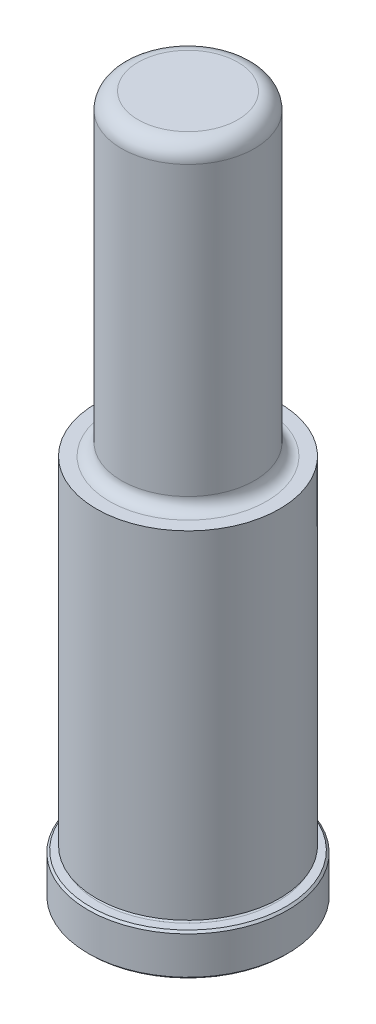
from build123d import *

# Parameters (mm, degrees)
CHAMFER1_SIZE = 0.381
FILLET7_R     = 3.175


with BuildPart() as part:
    # Sketch1 → Revolve1 (revolve)
    with BuildSketch(Plane(origin=(0, 0, 0), x_dir=(0, 0, -1), z_dir=(1, 0, 0)), mode=Mode.PRIVATE) as revolve1_sk:
        with BuildLine():
            Line((0, 0), (19.05, 0))
            Line((19.05, 0), (19.05, 7.9248))
            Line((19.05, 7.9248), (17.0688, 7.9248))
            ThreePointArc((17.0688, 7.9248), (16.6878, 8.3058), (17.0688, 8.6868))
            Line((17.0688, 8.6868), (17.4752, 8.6868))
            Line((17.4752, 8.6868), (17.4752, 73.025))
            Line((17.4752, 73.025), (14.9733, 73.025))
            ThreePointArc((14.9733, 73.025), (13.356853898, 73.694553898), (12.6873, 75.311))
            Line((12.6873, 75.311), (12.6873, 133.35))
            Line((12.6873, 133.35), (0, 133.35))
            Line((0, 133.35), (0, 0))
        make_face()
    revolve(revolve1_sk.sketch.rotate(Axis((0, 0, 0), (0, -1, 0)), 180), axis=Axis((0, 0, 0), (0, -1, 0)))

    # Chamfer1
    chamfer1_edges = [part.edges().sort_by_distance(p)[0] for p in [
        (0, 7.9248, -19.05),
        (0, 0, -19.05),
    ]]
    chamfer(chamfer1_edges, length=CHAMFER1_SIZE)

    # Fillet7
    fillet7_edges = [part.edges().sort_by_distance(p)[0] for p in [
        (0, 133.35, -12.6873),
    ]]
    fillet(fillet7_edges, radius=FILLET7_R)


solid = part.part
